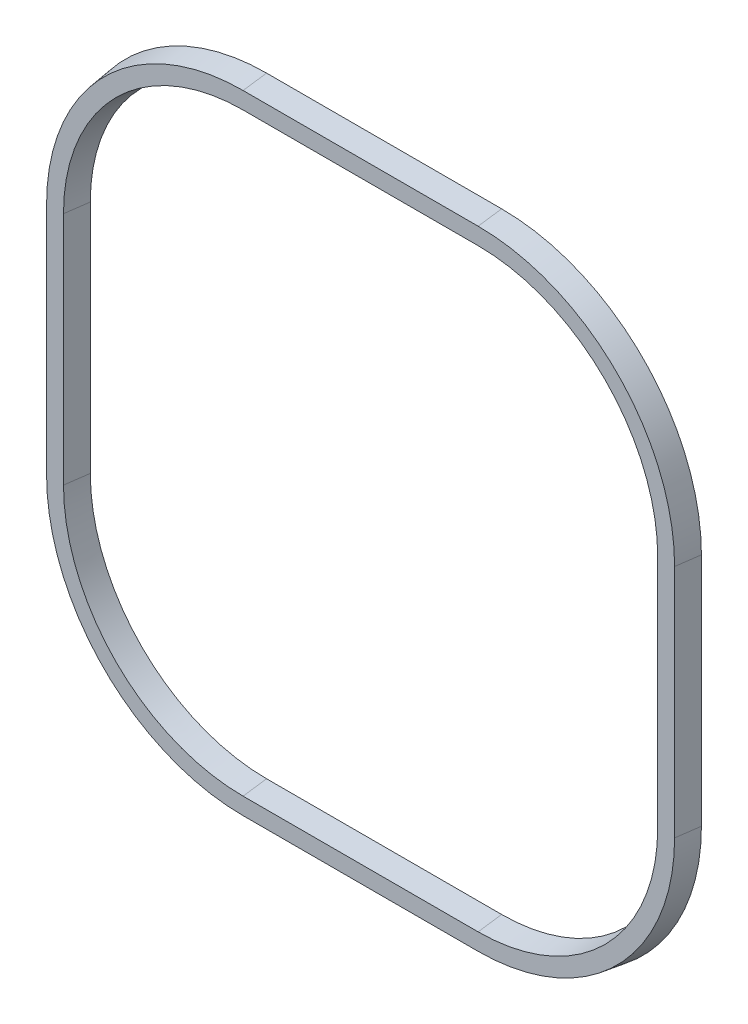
ISO-10303-21;
HEADER;
FILE_DESCRIPTION(('STEP AP214'),'2;1');
FILE_NAME('part.step','',(''),(''),'','','');
FILE_SCHEMA(('AUTOMOTIVE_DESIGN { 1 0 10303 214 1 1 1 1 }'));
ENDSEC;
DATA;
#1=APPLICATION_CONTEXT('core data for automotive mechanical design processes');
#2=APPLICATION_PROTOCOL_DEFINITION('international standard','automotive_design',2000,#1);
#3=PRODUCT_CONTEXT('',#1,'mechanical');
#4=PRODUCT('Part','Part','',(#3));
#5=PRODUCT_RELATED_PRODUCT_CATEGORY('part','',(#4));
#6=PRODUCT_DEFINITION_FORMATION('','',#4);
#7=PRODUCT_DEFINITION_CONTEXT('part definition',#1,'design');
#8=PRODUCT_DEFINITION('design','',#6,#7);
#9=PRODUCT_DEFINITION_SHAPE('','',#8);
#10=(LENGTH_UNIT() NAMED_UNIT(*) SI_UNIT(.MILLI.,.METRE.));
#11=(NAMED_UNIT(*) PLANE_ANGLE_UNIT() SI_UNIT($,.RADIAN.));
#12=(NAMED_UNIT(*) SI_UNIT($,.STERADIAN.) SOLID_ANGLE_UNIT());
#13=UNCERTAINTY_MEASURE_WITH_UNIT(LENGTH_MEASURE(1.E-05),#10,'distance_accuracy_value','');
#14=(GEOMETRIC_REPRESENTATION_CONTEXT(3) GLOBAL_UNCERTAINTY_ASSIGNED_CONTEXT((#13)) GLOBAL_UNIT_ASSIGNED_CONTEXT((#10,
#11,#12)) REPRESENTATION_CONTEXT('',''));
#15=CARTESIAN_POINT('',(0.,0.,0.));
#16=DIRECTION('',(0.,0.,1.));
#17=DIRECTION('',(1.,0.,0.));
#18=AXIS2_PLACEMENT_3D('',#15,#16,#17);
#19=CARTESIAN_POINT('',(43.075,45.,2.));
#20=DIRECTION('',(0.,0.,1.));
#21=DIRECTION('',(1.,0.,0.));
#22=AXIS2_PLACEMENT_3D('',#19,#20,#21);
#23=PLANE('',#22);
#24=CARTESIAN_POINT('',(43.075,45.,2.));
#25=DIRECTION('',(0.,0.,1.));
#26=DIRECTION('',(1.,0.,0.));
#27=AXIS2_PLACEMENT_3D('',#24,#25,#26);
#28=CIRCLE('',#27,16.7189183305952);
#29=CARTESIAN_POINT('',(59.7939183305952,45.,2.));
#30=VERTEX_POINT('',#29);
#31=CARTESIAN_POINT('',(43.075,61.7189183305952,2.));
#32=VERTEX_POINT('',#31);
#33=EDGE_CURVE('E165',#30,#32,#28,.T.);
#34=ORIENTED_EDGE('',*,*,#33,.T.);
#35=DIRECTION('',(1.,0.,0.));
#36=VECTOR('',#35,1.);
#37=CARTESIAN_POINT('',(43.075,61.7189183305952,2.));
#38=LINE('',#37,#36);
#39=CARTESIAN_POINT('',(23.075,61.7189183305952,2.));
#40=VERTEX_POINT('',#39);
#41=EDGE_CURVE('E185',#32,#40,#38,.F.);
#42=ORIENTED_EDGE('',*,*,#41,.T.);
#43=CARTESIAN_POINT('',(23.075,45.,2.));
#44=DIRECTION('',(0.,0.,1.));
#45=DIRECTION('',(1.,0.,0.));
#46=AXIS2_PLACEMENT_3D('',#43,#44,#45);
#47=CIRCLE('',#46,16.7189183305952);
#48=CARTESIAN_POINT('',(6.35608166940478,45.,2.));
#49=VERTEX_POINT('',#48);
#50=EDGE_CURVE('E188',#40,#49,#47,.T.);
#51=ORIENTED_EDGE('',*,*,#50,.T.);
#52=DIRECTION('',(0.,1.,0.));
#53=VECTOR('',#52,1.);
#54=CARTESIAN_POINT('',(6.35608166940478,45.,2.));
#55=LINE('',#54,#53);
#56=CARTESIAN_POINT('',(6.35608166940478,25.,2.));
#57=VERTEX_POINT('',#56);
#58=EDGE_CURVE('E198',#49,#57,#55,.F.);
#59=ORIENTED_EDGE('',*,*,#58,.T.);
#60=CARTESIAN_POINT('',(23.075,25.,2.));
#61=DIRECTION('',(0.,0.,1.));
#62=DIRECTION('',(1.,0.,0.));
#63=AXIS2_PLACEMENT_3D('',#60,#61,#62);
#64=CIRCLE('',#63,16.7189183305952);
#65=CARTESIAN_POINT('',(23.075,8.2810816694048,2.));
#66=VERTEX_POINT('',#65);
#67=EDGE_CURVE('E200',#57,#66,#64,.T.);
#68=ORIENTED_EDGE('',*,*,#67,.T.);
#69=DIRECTION('',(-1.,0.,0.));
#70=VECTOR('',#69,1.);
#71=CARTESIAN_POINT('',(23.075,8.2810816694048,2.));
#72=LINE('',#71,#70);
#73=CARTESIAN_POINT('',(43.075,8.2810816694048,2.));
#74=VERTEX_POINT('',#73);
#75=EDGE_CURVE('E202',#66,#74,#72,.F.);
#76=ORIENTED_EDGE('',*,*,#75,.T.);
#77=CARTESIAN_POINT('',(43.075,25.,2.));
#78=DIRECTION('',(0.,0.,1.));
#79=DIRECTION('',(1.,0.,0.));
#80=AXIS2_PLACEMENT_3D('',#77,#78,#79);
#81=CIRCLE('',#80,16.7189183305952);
#82=CARTESIAN_POINT('',(59.7939183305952,25.,2.));
#83=VERTEX_POINT('',#82);
#84=EDGE_CURVE('E168',#74,#83,#81,.T.);
#85=ORIENTED_EDGE('',*,*,#84,.T.);
#86=DIRECTION('',(0.,-1.,0.));
#87=VECTOR('',#86,1.);
#88=CARTESIAN_POINT('',(59.7939183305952,25.,2.));
#89=LINE('',#88,#87);
#90=EDGE_CURVE('E161',#83,#30,#89,.F.);
#91=ORIENTED_EDGE('',*,*,#90,.T.);
#92=EDGE_LOOP('',(#34,#42,#51,#59,#68,#76,#85,#91));
#93=FACE_BOUND('',#92,.T.);
#94=DIRECTION('',(0.,1.,0.));
#95=VECTOR('',#94,1.);
#96=CARTESIAN_POINT('',(58.3560816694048,25.,2.));
#97=LINE('',#96,#95);
#98=CARTESIAN_POINT('',(58.3560816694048,25.,2.));
#99=VERTEX_POINT('',#98);
#100=CARTESIAN_POINT('',(58.3560816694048,45.,2.));
#101=VERTEX_POINT('',#100);
#102=EDGE_CURVE('E49',#99,#101,#97,.T.);
#103=ORIENTED_EDGE('',*,*,#102,.F.);
#104=CARTESIAN_POINT('',(43.075,25.,2.));
#105=DIRECTION('',(0.,0.,1.));
#106=DIRECTION('',(1.,0.,0.));
#107=AXIS2_PLACEMENT_3D('',#104,#105,#106);
#108=CIRCLE('',#107,15.2810816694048);
#109=CARTESIAN_POINT('',(43.075,9.71891833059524,2.));
#110=VERTEX_POINT('',#109);
#111=EDGE_CURVE('E101',#110,#99,#108,.T.);
#112=ORIENTED_EDGE('',*,*,#111,.F.);
#113=DIRECTION('',(1.,0.,0.));
#114=VECTOR('',#113,1.);
#115=CARTESIAN_POINT('',(23.075,9.71891833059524,2.));
#116=LINE('',#115,#114);
#117=CARTESIAN_POINT('',(23.075,9.71891833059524,2.));
#118=VERTEX_POINT('',#117);
#119=EDGE_CURVE('E209',#118,#110,#116,.T.);
#120=ORIENTED_EDGE('',*,*,#119,.F.);
#121=CARTESIAN_POINT('',(23.075,25.,2.));
#122=DIRECTION('',(0.,0.,1.));
#123=DIRECTION('',(1.,0.,0.));
#124=AXIS2_PLACEMENT_3D('',#121,#122,#123);
#125=CIRCLE('',#124,15.2810816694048);
#126=CARTESIAN_POINT('',(7.79391833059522,25.,2.));
#127=VERTEX_POINT('',#126);
#128=EDGE_CURVE('E233',#127,#118,#125,.T.);
#129=ORIENTED_EDGE('',*,*,#128,.F.);
#130=DIRECTION('',(0.,-1.,0.));
#131=VECTOR('',#130,1.);
#132=CARTESIAN_POINT('',(7.79391833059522,45.,2.));
#133=LINE('',#132,#131);
#134=CARTESIAN_POINT('',(7.79391833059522,45.,2.));
#135=VERTEX_POINT('',#134);
#136=EDGE_CURVE('E235',#135,#127,#133,.T.);
#137=ORIENTED_EDGE('',*,*,#136,.F.);
#138=CARTESIAN_POINT('',(23.075,45.,2.));
#139=DIRECTION('',(0.,0.,1.));
#140=DIRECTION('',(1.,0.,0.));
#141=AXIS2_PLACEMENT_3D('',#138,#139,#140);
#142=CIRCLE('',#141,15.2810816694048);
#143=CARTESIAN_POINT('',(23.075,60.2810816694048,2.));
#144=VERTEX_POINT('',#143);
#145=EDGE_CURVE('E237',#144,#135,#142,.T.);
#146=ORIENTED_EDGE('',*,*,#145,.F.);
#147=DIRECTION('',(-1.,0.,0.));
#148=VECTOR('',#147,1.);
#149=CARTESIAN_POINT('',(43.075,60.2810816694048,2.));
#150=LINE('',#149,#148);
#151=CARTESIAN_POINT('',(43.075,60.2810816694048,2.));
#152=VERTEX_POINT('',#151);
#153=EDGE_CURVE('E240',#152,#144,#150,.T.);
#154=ORIENTED_EDGE('',*,*,#153,.F.);
#155=CARTESIAN_POINT('',(43.075,45.,2.));
#156=DIRECTION('',(0.,0.,1.));
#157=DIRECTION('',(1.,0.,0.));
#158=AXIS2_PLACEMENT_3D('',#155,#156,#157);
#159=CIRCLE('',#158,15.2810816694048);
#160=EDGE_CURVE('E242',#101,#152,#159,.T.);
#161=ORIENTED_EDGE('',*,*,#160,.F.);
#162=EDGE_LOOP('',(#103,#112,#120,#129,#137,#146,#154,#161));
#163=FACE_BOUND('',#162,.T.);
#164=ADVANCED_FACE('F45',(#93,#163),#23,.T.);
#165=CARTESIAN_POINT('',(43.075,45.,0.));
#166=DIRECTION('',(0.,0.,1.));
#167=DIRECTION('',(1.,0.,0.));
#168=AXIS2_PLACEMENT_3D('',#165,#166,#167);
#169=PLANE('',#168);
#170=CARTESIAN_POINT('',(43.075,45.,0.));
#171=DIRECTION('',(0.,0.,1.));
#172=DIRECTION('',(1.,0.,0.));
#173=AXIS2_PLACEMENT_3D('',#170,#171,#172);
#174=CIRCLE('',#173,17.);
#175=CARTESIAN_POINT('',(60.075,45.,0.));
#176=VERTEX_POINT('',#175);
#177=CARTESIAN_POINT('',(43.075,62.,0.));
#178=VERTEX_POINT('',#177);
#179=EDGE_CURVE('E213',#176,#178,#174,.T.);
#180=ORIENTED_EDGE('',*,*,#179,.F.);
#181=DIRECTION('',(0.,1.,0.));
#182=VECTOR('',#181,1.);
#183=CARTESIAN_POINT('',(60.075,25.,0.));
#184=LINE('',#183,#182);
#185=CARTESIAN_POINT('',(60.075,25.,0.));
#186=VERTEX_POINT('',#185);
#187=EDGE_CURVE('E178',#186,#176,#184,.T.);
#188=ORIENTED_EDGE('',*,*,#187,.F.);
#189=CARTESIAN_POINT('',(43.075,25.,0.));
#190=DIRECTION('',(0.,0.,1.));
#191=DIRECTION('',(1.,0.,0.));
#192=AXIS2_PLACEMENT_3D('',#189,#190,#191);
#193=CIRCLE('',#192,17.);
#194=CARTESIAN_POINT('',(43.075,8.00000000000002,0.));
#195=VERTEX_POINT('',#194);
#196=EDGE_CURVE('E191',#195,#186,#193,.T.);
#197=ORIENTED_EDGE('',*,*,#196,.F.);
#198=DIRECTION('',(1.,0.,0.));
#199=VECTOR('',#198,1.);
#200=CARTESIAN_POINT('',(23.075,8.00000000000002,0.));
#201=LINE('',#200,#199);
#202=CARTESIAN_POINT('',(23.075,8.00000000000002,0.));
#203=VERTEX_POINT('',#202);
#204=EDGE_CURVE('E282',#203,#195,#201,.T.);
#205=ORIENTED_EDGE('',*,*,#204,.F.);
#206=CARTESIAN_POINT('',(23.075,25.,0.));
#207=DIRECTION('',(0.,0.,1.));
#208=DIRECTION('',(1.,0.,0.));
#209=AXIS2_PLACEMENT_3D('',#206,#207,#208);
#210=CIRCLE('',#209,17.);
#211=CARTESIAN_POINT('',(6.075,25.,0.));
#212=VERTEX_POINT('',#211);
#213=EDGE_CURVE('E284',#212,#203,#210,.T.);
#214=ORIENTED_EDGE('',*,*,#213,.F.);
#215=DIRECTION('',(0.,-1.,0.));
#216=VECTOR('',#215,1.);
#217=CARTESIAN_POINT('',(6.075,45.,0.));
#218=LINE('',#217,#216);
#219=CARTESIAN_POINT('',(6.075,45.,0.));
#220=VERTEX_POINT('',#219);
#221=EDGE_CURVE('E286',#220,#212,#218,.T.);
#222=ORIENTED_EDGE('',*,*,#221,.F.);
#223=CARTESIAN_POINT('',(23.075,45.,0.));
#224=DIRECTION('',(0.,0.,1.));
#225=DIRECTION('',(1.,0.,0.));
#226=AXIS2_PLACEMENT_3D('',#223,#224,#225);
#227=CIRCLE('',#226,17.);
#228=CARTESIAN_POINT('',(23.075,62.,0.));
#229=VERTEX_POINT('',#228);
#230=EDGE_CURVE('E288',#229,#220,#227,.T.);
#231=ORIENTED_EDGE('',*,*,#230,.F.);
#232=DIRECTION('',(-1.,0.,0.));
#233=VECTOR('',#232,1.);
#234=CARTESIAN_POINT('',(43.075,62.,0.));
#235=LINE('',#234,#233);
#236=EDGE_CURVE('E291',#178,#229,#235,.T.);
#237=ORIENTED_EDGE('',*,*,#236,.F.);
#238=EDGE_LOOP('',(#180,#188,#197,#205,#214,#222,#231,#237));
#239=FACE_BOUND('',#238,.T.);
#240=CARTESIAN_POINT('',(43.075,25.,0.));
#241=DIRECTION('',(0.,0.,1.));
#242=DIRECTION('',(1.,0.,0.));
#243=AXIS2_PLACEMENT_3D('',#240,#241,#242);
#244=CIRCLE('',#243,15.);
#245=CARTESIAN_POINT('',(43.075,10.,0.));
#246=VERTEX_POINT('',#245);
#247=CARTESIAN_POINT('',(58.075,25.,0.));
#248=VERTEX_POINT('',#247);
#249=EDGE_CURVE('E251',#246,#248,#244,.T.);
#250=ORIENTED_EDGE('',*,*,#249,.T.);
#251=DIRECTION('',(0.,1.,0.));
#252=VECTOR('',#251,1.);
#253=CARTESIAN_POINT('',(58.075,25.,0.));
#254=LINE('',#253,#252);
#255=CARTESIAN_POINT('',(58.075,45.,0.));
#256=VERTEX_POINT('',#255);
#257=EDGE_CURVE('E248',#248,#256,#254,.T.);
#258=ORIENTED_EDGE('',*,*,#257,.T.);
#259=CARTESIAN_POINT('',(43.075,45.,0.));
#260=DIRECTION('',(0.,0.,1.));
#261=DIRECTION('',(1.,0.,0.));
#262=AXIS2_PLACEMENT_3D('',#259,#260,#261);
#263=CIRCLE('',#262,15.);
#264=CARTESIAN_POINT('',(43.075,60.,0.));
#265=VERTEX_POINT('',#264);
#266=EDGE_CURVE('E250',#256,#265,#263,.T.);
#267=ORIENTED_EDGE('',*,*,#266,.T.);
#268=DIRECTION('',(-1.,0.,0.));
#269=VECTOR('',#268,1.);
#270=CARTESIAN_POINT('',(43.075,60.,0.));
#271=LINE('',#270,#269);
#272=CARTESIAN_POINT('',(23.075,60.,0.));
#273=VERTEX_POINT('',#272);
#274=EDGE_CURVE('E307',#265,#273,#271,.T.);
#275=ORIENTED_EDGE('',*,*,#274,.T.);
#276=CARTESIAN_POINT('',(23.075,45.,0.));
#277=DIRECTION('',(0.,0.,1.));
#278=DIRECTION('',(1.,0.,0.));
#279=AXIS2_PLACEMENT_3D('',#276,#277,#278);
#280=CIRCLE('',#279,15.);
#281=CARTESIAN_POINT('',(8.075,45.,0.));
#282=VERTEX_POINT('',#281);
#283=EDGE_CURVE('E303',#273,#282,#280,.T.);
#284=ORIENTED_EDGE('',*,*,#283,.T.);
#285=DIRECTION('',(0.,-1.,0.));
#286=VECTOR('',#285,1.);
#287=CARTESIAN_POINT('',(8.075,45.,0.));
#288=LINE('',#287,#286);
#289=CARTESIAN_POINT('',(8.075,25.,0.));
#290=VERTEX_POINT('',#289);
#291=EDGE_CURVE('E300',#282,#290,#288,.T.);
#292=ORIENTED_EDGE('',*,*,#291,.T.);
#293=CARTESIAN_POINT('',(23.075,25.,0.));
#294=DIRECTION('',(0.,0.,1.));
#295=DIRECTION('',(1.,0.,0.));
#296=AXIS2_PLACEMENT_3D('',#293,#294,#295);
#297=CIRCLE('',#296,15.);
#298=CARTESIAN_POINT('',(23.075,10.,0.));
#299=VERTEX_POINT('',#298);
#300=EDGE_CURVE('E297',#290,#299,#297,.T.);
#301=ORIENTED_EDGE('',*,*,#300,.T.);
#302=DIRECTION('',(1.,0.,0.));
#303=VECTOR('',#302,1.);
#304=CARTESIAN_POINT('',(23.075,10.,0.));
#305=LINE('',#304,#303);
#306=EDGE_CURVE('E231',#299,#246,#305,.T.);
#307=ORIENTED_EDGE('',*,*,#306,.T.);
#308=EDGE_LOOP('',(#250,#258,#267,#275,#284,#292,#301,#307));
#309=FACE_BOUND('',#308,.T.);
#310=ADVANCED_FACE('F315',(#239,#309),#169,.F.);
#311=CARTESIAN_POINT('',(43.075,45.,0.));
#312=DIRECTION('',(0.,0.,-1.));
#313=DIRECTION('',(1.,0.,0.));
#314=AXIS2_PLACEMENT_3D('',#311,#312,#313);
#315=CONICAL_SURFACE('',#314,17.,0.139626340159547);
#316=ORIENTED_EDGE('',*,*,#179,.T.);
#317=DIRECTION('',(0.,0.139173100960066,-0.99026806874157));
#318=VECTOR('',#317,1.);
#319=CARTESIAN_POINT('',(43.075,62.,0.));
#320=LINE('',#319,#318);
#321=EDGE_CURVE('E11',#32,#178,#320,.T.);
#322=ORIENTED_EDGE('',*,*,#321,.F.);
#323=ORIENTED_EDGE('',*,*,#33,.F.);
#324=DIRECTION('',(0.139173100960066,0.,-0.99026806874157));
#325=VECTOR('',#324,1.);
#326=CARTESIAN_POINT('',(60.075,45.,0.));
#327=LINE('',#326,#325);
#328=EDGE_CURVE('E173',#30,#176,#327,.T.);
#329=ORIENTED_EDGE('',*,*,#328,.T.);
#330=EDGE_LOOP('',(#316,#322,#323,#329));
#331=FACE_BOUND('',#330,.T.);
#332=ADVANCED_FACE('F184',(#331),#315,.T.);
#333=CARTESIAN_POINT('',(43.075,62.,0.));
#334=DIRECTION('',(0.,0.99026806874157,0.139173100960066));
#335=DIRECTION('',(0.,-0.139173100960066,0.99026806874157));
#336=AXIS2_PLACEMENT_3D('',#333,#334,#335);
#337=PLANE('',#336);
#338=ORIENTED_EDGE('',*,*,#236,.T.);
#339=DIRECTION('',(0.,0.139173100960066,-0.99026806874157));
#340=VECTOR('',#339,1.);
#341=CARTESIAN_POINT('',(23.075,62.,0.));
#342=LINE('',#341,#340);
#343=EDGE_CURVE('E55',#40,#229,#342,.T.);
#344=ORIENTED_EDGE('',*,*,#343,.F.);
#345=ORIENTED_EDGE('',*,*,#41,.F.);
#346=ORIENTED_EDGE('',*,*,#321,.T.);
#347=EDGE_LOOP('',(#338,#344,#345,#346));
#348=FACE_BOUND('',#347,.T.);
#349=ADVANCED_FACE('F365',(#348),#337,.T.);
#350=CARTESIAN_POINT('',(23.075,45.,0.));
#351=DIRECTION('',(0.,0.,-1.));
#352=DIRECTION('',(1.,0.,0.));
#353=AXIS2_PLACEMENT_3D('',#350,#351,#352);
#354=CONICAL_SURFACE('',#353,17.,0.139626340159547);
#355=ORIENTED_EDGE('',*,*,#230,.T.);
#356=DIRECTION('',(-0.139173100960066,0.,-0.99026806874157));
#357=VECTOR('',#356,1.);
#358=CARTESIAN_POINT('',(6.075,45.,0.));
#359=LINE('',#358,#357);
#360=EDGE_CURVE('E261',#49,#220,#359,.T.);
#361=ORIENTED_EDGE('',*,*,#360,.F.);
#362=ORIENTED_EDGE('',*,*,#50,.F.);
#363=ORIENTED_EDGE('',*,*,#343,.T.);
#364=EDGE_LOOP('',(#355,#361,#362,#363));
#365=FACE_BOUND('',#364,.T.);
#366=ADVANCED_FACE('F383',(#365),#354,.T.);
#367=CARTESIAN_POINT('',(6.075,45.,0.));
#368=DIRECTION('',(-0.99026806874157,0.,0.139173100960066));
#369=DIRECTION('',(0.139173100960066,0.,0.99026806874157));
#370=AXIS2_PLACEMENT_3D('',#367,#368,#369);
#371=PLANE('',#370);
#372=ORIENTED_EDGE('',*,*,#221,.T.);
#373=DIRECTION('',(-0.139173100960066,0.,-0.99026806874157));
#374=VECTOR('',#373,1.);
#375=CARTESIAN_POINT('',(6.075,25.,0.));
#376=LINE('',#375,#374);
#377=EDGE_CURVE('E267',#57,#212,#376,.T.);
#378=ORIENTED_EDGE('',*,*,#377,.F.);
#379=ORIENTED_EDGE('',*,*,#58,.F.);
#380=ORIENTED_EDGE('',*,*,#360,.T.);
#381=EDGE_LOOP('',(#372,#378,#379,#380));
#382=FACE_BOUND('',#381,.T.);
#383=ADVANCED_FACE('F379',(#382),#371,.T.);
#384=CARTESIAN_POINT('',(23.075,25.,0.));
#385=DIRECTION('',(0.,0.,-1.));
#386=DIRECTION('',(1.,0.,0.));
#387=AXIS2_PLACEMENT_3D('',#384,#385,#386);
#388=CONICAL_SURFACE('',#387,17.,0.139626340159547);
#389=ORIENTED_EDGE('',*,*,#213,.T.);
#390=DIRECTION('',(0.,-0.139173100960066,-0.99026806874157));
#391=VECTOR('',#390,1.);
#392=CARTESIAN_POINT('',(23.075,8.00000000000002,0.));
#393=LINE('',#392,#391);
#394=EDGE_CURVE('E273',#66,#203,#393,.T.);
#395=ORIENTED_EDGE('',*,*,#394,.F.);
#396=ORIENTED_EDGE('',*,*,#67,.F.);
#397=ORIENTED_EDGE('',*,*,#377,.T.);
#398=EDGE_LOOP('',(#389,#395,#396,#397));
#399=FACE_BOUND('',#398,.T.);
#400=ADVANCED_FACE('F375',(#399),#388,.T.);
#401=CARTESIAN_POINT('',(23.075,8.00000000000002,0.));
#402=DIRECTION('',(0.,-0.99026806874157,0.139173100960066));
#403=DIRECTION('',(0.,-0.139173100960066,-0.99026806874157));
#404=AXIS2_PLACEMENT_3D('',#401,#402,#403);
#405=PLANE('',#404);
#406=ORIENTED_EDGE('',*,*,#204,.T.);
#407=DIRECTION('',(0.,-0.139173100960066,-0.99026806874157));
#408=VECTOR('',#407,1.);
#409=CARTESIAN_POINT('',(43.075,8.00000000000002,0.));
#410=LINE('',#409,#408);
#411=EDGE_CURVE('E254',#74,#195,#410,.T.);
#412=ORIENTED_EDGE('',*,*,#411,.F.);
#413=ORIENTED_EDGE('',*,*,#75,.F.);
#414=ORIENTED_EDGE('',*,*,#394,.T.);
#415=EDGE_LOOP('',(#406,#412,#413,#414));
#416=FACE_BOUND('',#415,.T.);
#417=ADVANCED_FACE('F371',(#416),#405,.T.);
#418=CARTESIAN_POINT('',(43.075,25.,0.));
#419=DIRECTION('',(0.,0.,-1.));
#420=DIRECTION('',(1.,0.,0.));
#421=AXIS2_PLACEMENT_3D('',#418,#419,#420);
#422=CONICAL_SURFACE('',#421,17.,0.139626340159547);
#423=ORIENTED_EDGE('',*,*,#196,.T.);
#424=DIRECTION('',(0.139173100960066,0.,-0.99026806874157));
#425=VECTOR('',#424,1.);
#426=CARTESIAN_POINT('',(60.075,25.,0.));
#427=LINE('',#426,#425);
#428=EDGE_CURVE('E182',#83,#186,#427,.T.);
#429=ORIENTED_EDGE('',*,*,#428,.F.);
#430=ORIENTED_EDGE('',*,*,#84,.F.);
#431=ORIENTED_EDGE('',*,*,#411,.T.);
#432=EDGE_LOOP('',(#423,#429,#430,#431));
#433=FACE_BOUND('',#432,.T.);
#434=ADVANCED_FACE('F368',(#433),#422,.T.);
#435=CARTESIAN_POINT('',(60.075,25.,0.));
#436=DIRECTION('',(0.99026806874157,0.,0.139173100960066));
#437=DIRECTION('',(0.139173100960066,0.,-0.99026806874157));
#438=AXIS2_PLACEMENT_3D('',#435,#436,#437);
#439=PLANE('',#438);
#440=ORIENTED_EDGE('',*,*,#187,.T.);
#441=ORIENTED_EDGE('',*,*,#328,.F.);
#442=ORIENTED_EDGE('',*,*,#90,.F.);
#443=ORIENTED_EDGE('',*,*,#428,.T.);
#444=EDGE_LOOP('',(#440,#441,#442,#443));
#445=FACE_BOUND('',#444,.T.);
#446=ADVANCED_FACE('F176',(#445),#439,.T.);
#447=CARTESIAN_POINT('',(43.075,25.,0.));
#448=DIRECTION('',(0.,0.,1.));
#449=DIRECTION('',(1.,0.,0.));
#450=AXIS2_PLACEMENT_3D('',#447,#448,#449);
#451=CONICAL_SURFACE('',#450,15.,0.139626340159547);
#452=ORIENTED_EDGE('',*,*,#249,.F.);
#453=DIRECTION('',(0.,0.139173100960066,-0.99026806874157));
#454=VECTOR('',#453,1.);
#455=CARTESIAN_POINT('',(43.075,10.,0.));
#456=LINE('',#455,#454);
#457=EDGE_CURVE('E206',#110,#246,#456,.T.);
#458=ORIENTED_EDGE('',*,*,#457,.F.);
#459=ORIENTED_EDGE('',*,*,#111,.T.);
#460=DIRECTION('',(-0.139173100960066,0.,-0.99026806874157));
#461=VECTOR('',#460,1.);
#462=CARTESIAN_POINT('',(58.075,25.,0.));
#463=LINE('',#462,#461);
#464=EDGE_CURVE('E210',#99,#248,#463,.T.);
#465=ORIENTED_EDGE('',*,*,#464,.T.);
#466=EDGE_LOOP('',(#452,#458,#459,#465));
#467=FACE_BOUND('',#466,.T.);
#468=ADVANCED_FACE('F342',(#467),#451,.F.);
#469=CARTESIAN_POINT('',(58.075,25.,0.));
#470=DIRECTION('',(-0.99026806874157,0.,0.139173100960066));
#471=DIRECTION('',(0.139173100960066,0.,0.99026806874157));
#472=AXIS2_PLACEMENT_3D('',#469,#470,#471);
#473=PLANE('',#472);
#474=ORIENTED_EDGE('',*,*,#257,.F.);
#475=ORIENTED_EDGE('',*,*,#464,.F.);
#476=ORIENTED_EDGE('',*,*,#102,.T.);
#477=DIRECTION('',(-0.139173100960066,0.,-0.99026806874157));
#478=VECTOR('',#477,1.);
#479=CARTESIAN_POINT('',(58.075,45.,0.));
#480=LINE('',#479,#478);
#481=EDGE_CURVE('E214',#101,#256,#480,.T.);
#482=ORIENTED_EDGE('',*,*,#481,.T.);
#483=EDGE_LOOP('',(#474,#475,#476,#482));
#484=FACE_BOUND('',#483,.T.);
#485=ADVANCED_FACE('F343',(#484),#473,.T.);
#486=CARTESIAN_POINT('',(43.075,45.,0.));
#487=DIRECTION('',(0.,0.,1.));
#488=DIRECTION('',(1.,0.,0.));
#489=AXIS2_PLACEMENT_3D('',#486,#487,#488);
#490=CONICAL_SURFACE('',#489,15.,0.139626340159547);
#491=ORIENTED_EDGE('',*,*,#266,.F.);
#492=ORIENTED_EDGE('',*,*,#481,.F.);
#493=ORIENTED_EDGE('',*,*,#160,.T.);
#494=DIRECTION('',(0.,-0.139173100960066,-0.99026806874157));
#495=VECTOR('',#494,1.);
#496=CARTESIAN_POINT('',(43.075,60.,0.));
#497=LINE('',#496,#495);
#498=EDGE_CURVE('E216',#152,#265,#497,.T.);
#499=ORIENTED_EDGE('',*,*,#498,.T.);
#500=EDGE_LOOP('',(#491,#492,#493,#499));
#501=FACE_BOUND('',#500,.T.);
#502=ADVANCED_FACE('F321',(#501),#490,.F.);
#503=CARTESIAN_POINT('',(43.075,60.,0.));
#504=DIRECTION('',(0.,-0.99026806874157,0.139173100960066));
#505=DIRECTION('',(0.,-0.139173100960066,-0.99026806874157));
#506=AXIS2_PLACEMENT_3D('',#503,#504,#505);
#507=PLANE('',#506);
#508=ORIENTED_EDGE('',*,*,#274,.F.);
#509=ORIENTED_EDGE('',*,*,#498,.F.);
#510=ORIENTED_EDGE('',*,*,#153,.T.);
#511=DIRECTION('',(0.,-0.139173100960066,-0.99026806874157));
#512=VECTOR('',#511,1.);
#513=CARTESIAN_POINT('',(23.075,60.,0.));
#514=LINE('',#513,#512);
#515=EDGE_CURVE('E219',#144,#273,#514,.T.);
#516=ORIENTED_EDGE('',*,*,#515,.T.);
#517=EDGE_LOOP('',(#508,#509,#510,#516));
#518=FACE_BOUND('',#517,.T.);
#519=ADVANCED_FACE('F346',(#518),#507,.T.);
#520=CARTESIAN_POINT('',(23.075,45.,0.));
#521=DIRECTION('',(0.,0.,1.));
#522=DIRECTION('',(1.,0.,0.));
#523=AXIS2_PLACEMENT_3D('',#520,#521,#522);
#524=CONICAL_SURFACE('',#523,15.,0.139626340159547);
#525=ORIENTED_EDGE('',*,*,#283,.F.);
#526=ORIENTED_EDGE('',*,*,#515,.F.);
#527=ORIENTED_EDGE('',*,*,#145,.T.);
#528=DIRECTION('',(0.139173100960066,0.,-0.99026806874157));
#529=VECTOR('',#528,1.);
#530=CARTESIAN_POINT('',(8.075,45.,0.));
#531=LINE('',#530,#529);
#532=EDGE_CURVE('E223',#135,#282,#531,.T.);
#533=ORIENTED_EDGE('',*,*,#532,.T.);
#534=EDGE_LOOP('',(#525,#526,#527,#533));
#535=FACE_BOUND('',#534,.T.);
#536=ADVANCED_FACE('F332',(#535),#524,.F.);
#537=CARTESIAN_POINT('',(8.075,45.,0.));
#538=DIRECTION('',(0.99026806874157,0.,0.139173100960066));
#539=DIRECTION('',(0.139173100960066,0.,-0.99026806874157));
#540=AXIS2_PLACEMENT_3D('',#537,#538,#539);
#541=PLANE('',#540);
#542=ORIENTED_EDGE('',*,*,#291,.F.);
#543=ORIENTED_EDGE('',*,*,#532,.F.);
#544=ORIENTED_EDGE('',*,*,#136,.T.);
#545=DIRECTION('',(0.139173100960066,0.,-0.99026806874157));
#546=VECTOR('',#545,1.);
#547=CARTESIAN_POINT('',(8.075,25.,0.));
#548=LINE('',#547,#546);
#549=EDGE_CURVE('E226',#127,#290,#548,.T.);
#550=ORIENTED_EDGE('',*,*,#549,.T.);
#551=EDGE_LOOP('',(#542,#543,#544,#550));
#552=FACE_BOUND('',#551,.T.);
#553=ADVANCED_FACE('F337',(#552),#541,.T.);
#554=CARTESIAN_POINT('',(23.075,25.,0.));
#555=DIRECTION('',(0.,0.,1.));
#556=DIRECTION('',(1.,0.,0.));
#557=AXIS2_PLACEMENT_3D('',#554,#555,#556);
#558=CONICAL_SURFACE('',#557,15.,0.139626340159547);
#559=ORIENTED_EDGE('',*,*,#300,.F.);
#560=ORIENTED_EDGE('',*,*,#549,.F.);
#561=ORIENTED_EDGE('',*,*,#128,.T.);
#562=DIRECTION('',(0.,0.139173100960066,-0.99026806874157));
#563=VECTOR('',#562,1.);
#564=CARTESIAN_POINT('',(23.075,10.,0.));
#565=LINE('',#564,#563);
#566=EDGE_CURVE('E64',#118,#299,#565,.T.);
#567=ORIENTED_EDGE('',*,*,#566,.T.);
#568=EDGE_LOOP('',(#559,#560,#561,#567));
#569=FACE_BOUND('',#568,.T.);
#570=ADVANCED_FACE('F339',(#569),#558,.F.);
#571=CARTESIAN_POINT('',(23.075,10.,0.));
#572=DIRECTION('',(0.,0.99026806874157,0.139173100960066));
#573=DIRECTION('',(0.,-0.139173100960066,0.99026806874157));
#574=AXIS2_PLACEMENT_3D('',#571,#572,#573);
#575=PLANE('',#574);
#576=ORIENTED_EDGE('',*,*,#306,.F.);
#577=ORIENTED_EDGE('',*,*,#566,.F.);
#578=ORIENTED_EDGE('',*,*,#119,.T.);
#579=ORIENTED_EDGE('',*,*,#457,.T.);
#580=EDGE_LOOP('',(#576,#577,#578,#579));
#581=FACE_BOUND('',#580,.T.);
#582=ADVANCED_FACE('F47',(#581),#575,.T.);
#583=CLOSED_SHELL('',(#164,#310,#332,#349,#366,#383,#400,#417,#434,#446,#468,#485,#502,#519,
#536,#553,#570,#582));
#584=MANIFOLD_SOLID_BREP('B2',#583);
#585=ADVANCED_BREP_SHAPE_REPRESENTATION('',(#18,#584),#14);
#586=SHAPE_DEFINITION_REPRESENTATION(#9,#585);
ENDSEC;
END-ISO-10303-21;
